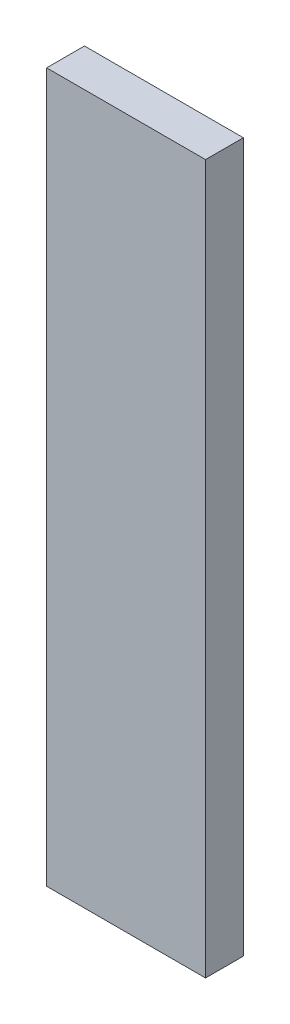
from build123d import *

# Parameters (mm, degrees)
SKETCH_1_W      = 315
SKETCH_1_H      = 1405
EXTRUDE_1_DEPTH = 75


with BuildPart() as part:
    # Sketch 1 → Extrude 1 (new body)
    with BuildSketch(Plane.XY):
        Rectangle(SKETCH_1_W, SKETCH_1_H)
    extrude(amount=-EXTRUDE_1_DEPTH)


solid = part.part
